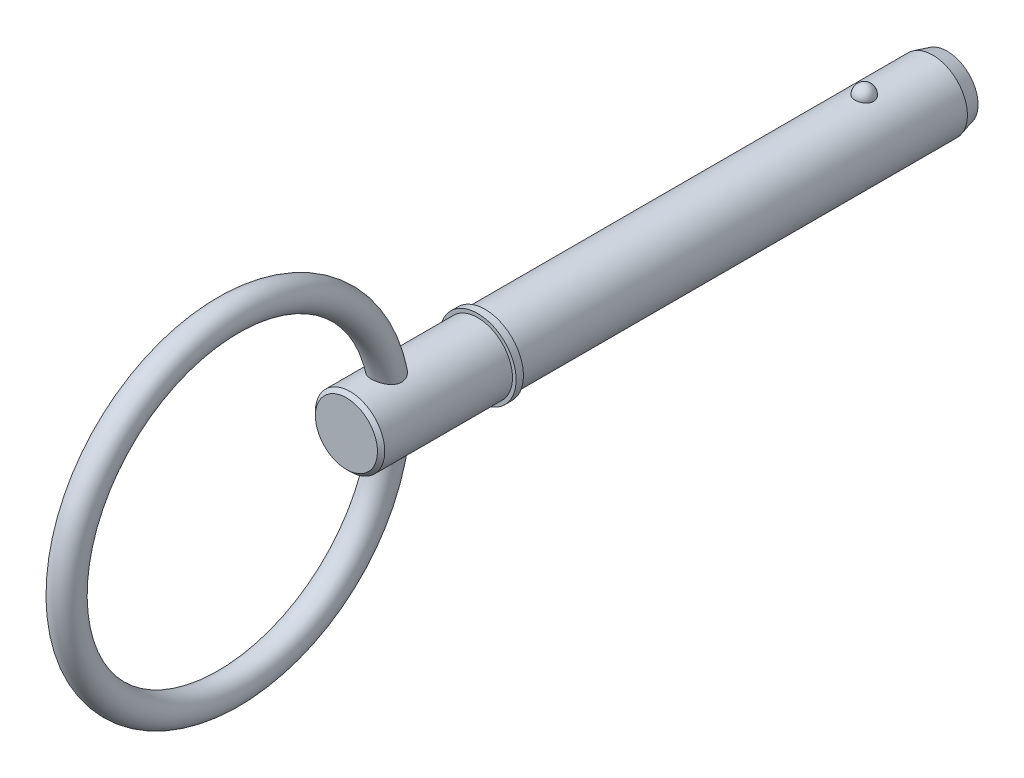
from build123d import *

# Parameters (mm, degrees)
SKETCH2_R           = 4.765
BOSS_EXTRUDE1_DEPTH = 50.8
BOSS_EXTRUDE2_START = 12.7
SKETCH3_R           = 4.765
BOSS_EXTRUDE2_DEPTH = 12.7
CHAMFER1_SIZE       = 2
CHAMFER1_SIZE2      = 0.535898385
SKETCH20_W          = 1
SKETCH20_H          = 5.265
SKETCH21_R          = 4.765
BOSS_EXTRUDE3_DEPTH = 19.05
CHAMFER2_SIZE       = 0.5
SKETCH24_R          = 2


with BuildPart() as part:
    # Sketch2 → Boss-Extrude1 (new body)
    with BuildSketch(Plane.XY):
        Circle(SKETCH2_R)
    extrude(amount=BOSS_EXTRUDE1_DEPTH)

    # Sketch3 → Boss-Extrude2 (add)
    with BuildSketch(Plane(origin=(0, 0, 0), x_dir=(-1, 0, 0), z_dir=(0, 0, -1)).offset(BOSS_EXTRUDE2_START)):
        Circle(SKETCH3_R)
    extrude(amount=-BOSS_EXTRUDE2_DEPTH)

    # Chamfer1
    chamfer1_edges = [part.edges().sort_by_distance(p)[0] for p in [
        (4.765, 0, -12.7),
    ]]
    chamfer1_side = [part.faces().sort_by_distance(p)[0] for p in [
        (4.765, 0, -6.35),
    ]]
    chamfer(chamfer1_edges, length=CHAMFER1_SIZE, length2=CHAMFER1_SIZE2, reference=chamfer1_side[0])

    # Sketch18 → Revolve1 (revolve)
    with BuildSketch(Plane(origin=(0, 0, 0), x_dir=(0, 0, -1), z_dir=(1, 0, 0))):
        with BuildLine():
            Line((1.29, 6.055), (1.29, 3.475))
            ThreePointArc((1.29, 3.475), (0, 4.765), (1.29, 6.055))
        make_face()
    revolve(axis=Axis((0, 6.055, -1.29), (0, -1, 0)))

    # Sketch20 → Revolve2 (revolve)
    with BuildSketch(Plane(origin=(0, 0, 0), x_dir=(0, 0, -1), z_dir=(1, 0, 0)), mode=Mode.PRIVATE) as revolve2_sk:
        with Locations((-51.3, 2.6325)):
            Rectangle(SKETCH20_W, SKETCH20_H)
    revolve(revolve2_sk.sketch.rotate(Axis((0, 0, 33.728787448), (0, 0, 1)), 90), axis=Axis((0, 0, 33.728787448), (0, 0, 1)))

    # Sketch21 → Boss-Extrude3 (add)
    with BuildSketch(Plane(origin=(0, 0, 50.8), x_dir=(-1, 0, 0), z_dir=(0, 0, -1))):
        Circle(SKETCH21_R)
    extrude(amount=-BOSS_EXTRUDE3_DEPTH)

    # Chamfer2
    chamfer2_edges = [part.edges().sort_by_distance(p)[0] for p in [
        (4.765, 0, 69.85),
    ]]
    chamfer(chamfer2_edges, length=CHAMFER2_SIZE)

    # Sweep1: sweep along a path in Sketch23
    with BuildLine(Plane(origin=(0, 0, 0), x_dir=(0, 0, -1), z_dir=(1, 0, 0))) as sweep1_path:
        CenterArc((-86.075, 0), 22.225, 0, 360)
    # Sketch24 → Sweep1 (sweep)
    with BuildSketch(Plane(origin=(0, 0, 0), x_dir=(1, 0, 0), z_dir=(0, 1, 0))):
        with Locations((0, -63.85)):
            Circle(SKETCH24_R)
    sweep(path=sweep1_path.line)


solid = part.part
